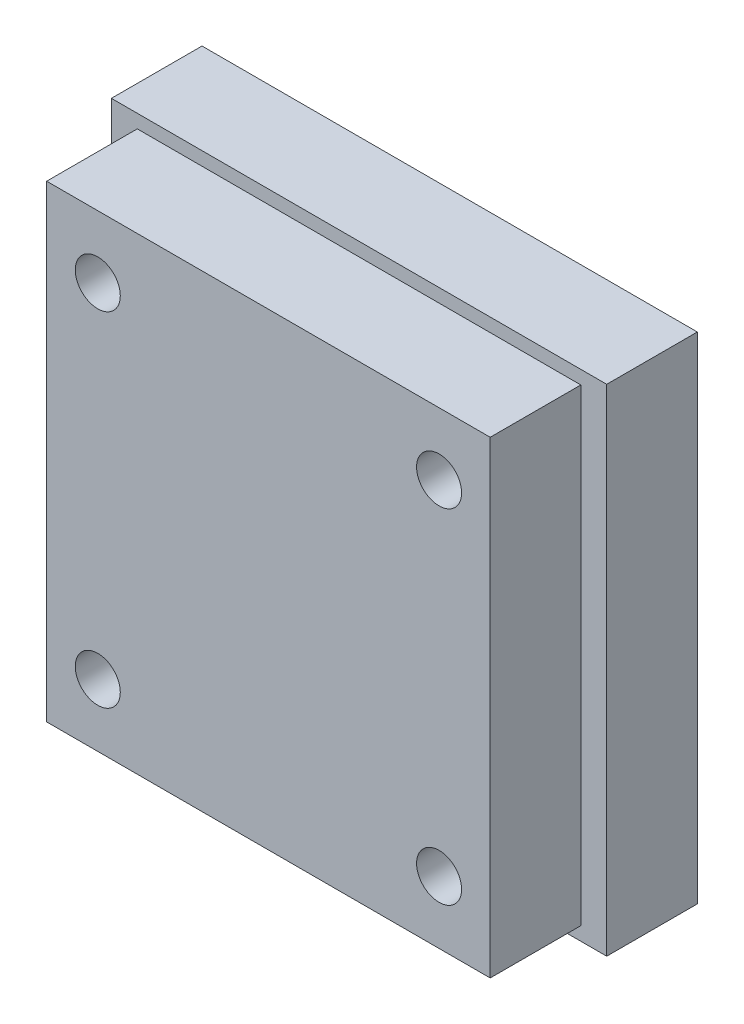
ISO-10303-21;
HEADER;
FILE_DESCRIPTION(('STEP AP214'),'2;1');
FILE_NAME('part.step','',(''),(''),'','','');
FILE_SCHEMA(('AUTOMOTIVE_DESIGN { 1 0 10303 214 1 1 1 1 }'));
ENDSEC;
DATA;
#1=APPLICATION_CONTEXT('core data for automotive mechanical design processes');
#2=APPLICATION_PROTOCOL_DEFINITION('international standard','automotive_design',2000,#1);
#3=PRODUCT_CONTEXT('',#1,'mechanical');
#4=PRODUCT('Part','Part','',(#3));
#5=PRODUCT_RELATED_PRODUCT_CATEGORY('part','',(#4));
#6=PRODUCT_DEFINITION_FORMATION('','',#4);
#7=PRODUCT_DEFINITION_CONTEXT('part definition',#1,'design');
#8=PRODUCT_DEFINITION('design','',#6,#7);
#9=PRODUCT_DEFINITION_SHAPE('','',#8);
#10=(LENGTH_UNIT() NAMED_UNIT(*) SI_UNIT(.MILLI.,.METRE.));
#11=(NAMED_UNIT(*) PLANE_ANGLE_UNIT() SI_UNIT($,.RADIAN.));
#12=(NAMED_UNIT(*) SI_UNIT($,.STERADIAN.) SOLID_ANGLE_UNIT());
#13=UNCERTAINTY_MEASURE_WITH_UNIT(LENGTH_MEASURE(1.E-05),#10,'distance_accuracy_value','');
#14=(GEOMETRIC_REPRESENTATION_CONTEXT(3) GLOBAL_UNCERTAINTY_ASSIGNED_CONTEXT((#13)) GLOBAL_UNIT_ASSIGNED_CONTEXT((#10,
#11,#12)) REPRESENTATION_CONTEXT('',''));
#15=CARTESIAN_POINT('',(0.,0.,0.));
#16=DIRECTION('',(0.,0.,1.));
#17=DIRECTION('',(1.,0.,0.));
#18=AXIS2_PLACEMENT_3D('',#15,#16,#17);
#19=CARTESIAN_POINT('',(0.,0.,8.05));
#20=DIRECTION('',(0.,0.,-1.));
#21=DIRECTION('',(-1.,0.,0.));
#22=AXIS2_PLACEMENT_3D('',#19,#20,#21);
#23=PLANE('',#22);
#24=DIRECTION('',(0.,1.,0.));
#25=VECTOR('',#24,1.);
#26=CARTESIAN_POINT('',(22.,-22.,8.05));
#27=LINE('',#26,#25);
#28=CARTESIAN_POINT('',(22.,-22.,8.05));
#29=VERTEX_POINT('',#28);
#30=CARTESIAN_POINT('',(22.,22.,8.05));
#31=VERTEX_POINT('',#30);
#32=EDGE_CURVE('E149',#29,#31,#27,.T.);
#33=ORIENTED_EDGE('',*,*,#32,.T.);
#34=DIRECTION('',(-1.,0.,0.));
#35=VECTOR('',#34,1.);
#36=CARTESIAN_POINT('',(-22.,22.,8.05));
#37=LINE('',#36,#35);
#38=CARTESIAN_POINT('',(-22.,22.,8.05));
#39=VERTEX_POINT('',#38);
#40=EDGE_CURVE('E153',#31,#39,#37,.T.);
#41=ORIENTED_EDGE('',*,*,#40,.T.);
#42=DIRECTION('',(0.,-1.,0.));
#43=VECTOR('',#42,1.);
#44=CARTESIAN_POINT('',(-22.,-22.,8.05));
#45=LINE('',#44,#43);
#46=CARTESIAN_POINT('',(-22.,-22.,8.05));
#47=VERTEX_POINT('',#46);
#48=EDGE_CURVE('E157',#39,#47,#45,.T.);
#49=ORIENTED_EDGE('',*,*,#48,.T.);
#50=DIRECTION('',(1.,0.,0.));
#51=VECTOR('',#50,1.);
#52=CARTESIAN_POINT('',(-22.,-22.,8.05));
#53=LINE('',#52,#51);
#54=EDGE_CURVE('E160',#47,#29,#53,.T.);
#55=ORIENTED_EDGE('',*,*,#54,.T.);
#56=EDGE_LOOP('',(#33,#41,#49,#55));
#57=FACE_BOUND('',#56,.T.);
#58=DIRECTION('',(0.,1.,0.));
#59=VECTOR('',#58,1.);
#60=CARTESIAN_POINT('',(19.7,-20.8,8.05));
#61=LINE('',#60,#59);
#62=CARTESIAN_POINT('',(19.7,-20.8,8.05));
#63=VERTEX_POINT('',#62);
#64=CARTESIAN_POINT('',(19.7,20.8,8.05));
#65=VERTEX_POINT('',#64);
#66=EDGE_CURVE('E65',#63,#65,#61,.T.);
#67=ORIENTED_EDGE('',*,*,#66,.F.);
#68=DIRECTION('',(1.,0.,0.));
#69=VECTOR('',#68,1.);
#70=CARTESIAN_POINT('',(-19.7,-20.8,8.05));
#71=LINE('',#70,#69);
#72=CARTESIAN_POINT('',(-19.7,-20.8,8.05));
#73=VERTEX_POINT('',#72);
#74=EDGE_CURVE('E69',#73,#63,#71,.T.);
#75=ORIENTED_EDGE('',*,*,#74,.F.);
#76=DIRECTION('',(0.,-1.,0.));
#77=VECTOR('',#76,1.);
#78=CARTESIAN_POINT('',(-19.7,-20.8,8.05));
#79=LINE('',#78,#77);
#80=CARTESIAN_POINT('',(-19.7,20.8,8.05));
#81=VERTEX_POINT('',#80);
#82=EDGE_CURVE('E428',#81,#73,#79,.T.);
#83=ORIENTED_EDGE('',*,*,#82,.F.);
#84=DIRECTION('',(-1.,0.,0.));
#85=VECTOR('',#84,1.);
#86=CARTESIAN_POINT('',(-19.7,20.8,8.05));
#87=LINE('',#86,#85);
#88=EDGE_CURVE('E425',#65,#81,#87,.T.);
#89=ORIENTED_EDGE('',*,*,#88,.F.);
#90=EDGE_LOOP('',(#67,#75,#83,#89));
#91=FACE_BOUND('',#90,.T.);
#92=ADVANCED_FACE('F49',(#57,#91),#23,.F.);
#93=CARTESIAN_POINT('',(22.,-22.,8.05));
#94=DIRECTION('',(-1.,0.,0.));
#95=DIRECTION('',(0.,0.,1.));
#96=AXIS2_PLACEMENT_3D('',#93,#94,#95);
#97=PLANE('',#96);
#98=DIRECTION('',(0.,1.,0.));
#99=VECTOR('',#98,1.);
#100=CARTESIAN_POINT('',(22.,-22.,0.));
#101=LINE('',#100,#99);
#102=CARTESIAN_POINT('',(22.,-22.,0.));
#103=VERTEX_POINT('',#102);
#104=CARTESIAN_POINT('',(22.,22.,0.));
#105=VERTEX_POINT('',#104);
#106=EDGE_CURVE('E138',#103,#105,#101,.T.);
#107=ORIENTED_EDGE('',*,*,#106,.T.);
#108=DIRECTION('',(0.,0.,-1.));
#109=VECTOR('',#108,1.);
#110=CARTESIAN_POINT('',(22.,22.,8.05));
#111=LINE('',#110,#109);
#112=EDGE_CURVE('E11',#31,#105,#111,.T.);
#113=ORIENTED_EDGE('',*,*,#112,.F.);
#114=ORIENTED_EDGE('',*,*,#32,.F.);
#115=DIRECTION('',(0.,0.,-1.));
#116=VECTOR('',#115,1.);
#117=CARTESIAN_POINT('',(22.,-22.,8.05));
#118=LINE('',#117,#116);
#119=EDGE_CURVE('E162',#29,#103,#118,.T.);
#120=ORIENTED_EDGE('',*,*,#119,.T.);
#121=EDGE_LOOP('',(#107,#113,#114,#120));
#122=FACE_BOUND('',#121,.T.);
#123=ADVANCED_FACE('F51',(#122),#97,.F.);
#124=CARTESIAN_POINT('',(-22.,22.,8.05));
#125=DIRECTION('',(0.,-1.,0.));
#126=DIRECTION('',(0.,0.,-1.));
#127=AXIS2_PLACEMENT_3D('',#124,#125,#126);
#128=PLANE('',#127);
#129=DIRECTION('',(-1.,0.,0.));
#130=VECTOR('',#129,1.);
#131=CARTESIAN_POINT('',(-22.,22.,0.));
#132=LINE('',#131,#130);
#133=CARTESIAN_POINT('',(-22.,22.,0.));
#134=VERTEX_POINT('',#133);
#135=EDGE_CURVE('E143',#105,#134,#132,.T.);
#136=ORIENTED_EDGE('',*,*,#135,.T.);
#137=DIRECTION('',(0.,0.,-1.));
#138=VECTOR('',#137,1.);
#139=CARTESIAN_POINT('',(-22.,22.,8.05));
#140=LINE('',#139,#138);
#141=EDGE_CURVE('E58',#39,#134,#140,.T.);
#142=ORIENTED_EDGE('',*,*,#141,.F.);
#143=ORIENTED_EDGE('',*,*,#40,.F.);
#144=ORIENTED_EDGE('',*,*,#112,.T.);
#145=EDGE_LOOP('',(#136,#142,#143,#144));
#146=FACE_BOUND('',#145,.T.);
#147=ADVANCED_FACE('F198',(#146),#128,.F.);
#148=CARTESIAN_POINT('',(-22.,-22.,8.05));
#149=DIRECTION('',(1.,0.,0.));
#150=DIRECTION('',(0.,0.,-1.));
#151=AXIS2_PLACEMENT_3D('',#148,#149,#150);
#152=PLANE('',#151);
#153=DIRECTION('',(0.,-1.,0.));
#154=VECTOR('',#153,1.);
#155=CARTESIAN_POINT('',(-22.,-22.,0.));
#156=LINE('',#155,#154);
#157=CARTESIAN_POINT('',(-22.,-22.,0.));
#158=VERTEX_POINT('',#157);
#159=EDGE_CURVE('E166',#134,#158,#156,.T.);
#160=ORIENTED_EDGE('',*,*,#159,.T.);
#161=DIRECTION('',(0.,0.,-1.));
#162=VECTOR('',#161,1.);
#163=CARTESIAN_POINT('',(-22.,-22.,8.05));
#164=LINE('',#163,#162);
#165=EDGE_CURVE('E174',#47,#158,#164,.T.);
#166=ORIENTED_EDGE('',*,*,#165,.F.);
#167=ORIENTED_EDGE('',*,*,#48,.F.);
#168=ORIENTED_EDGE('',*,*,#141,.T.);
#169=EDGE_LOOP('',(#160,#166,#167,#168));
#170=FACE_BOUND('',#169,.T.);
#171=ADVANCED_FACE('F183',(#170),#152,.F.);
#172=CARTESIAN_POINT('',(-22.,-22.,8.05));
#173=DIRECTION('',(0.,1.,0.));
#174=DIRECTION('',(-1.,0.,0.));
#175=AXIS2_PLACEMENT_3D('',#172,#173,#174);
#176=PLANE('',#175);
#177=DIRECTION('',(1.,0.,0.));
#178=VECTOR('',#177,1.);
#179=CARTESIAN_POINT('',(-22.,-22.,0.));
#180=LINE('',#179,#178);
#181=EDGE_CURVE('E154',#158,#103,#180,.T.);
#182=ORIENTED_EDGE('',*,*,#181,.T.);
#183=ORIENTED_EDGE('',*,*,#119,.F.);
#184=ORIENTED_EDGE('',*,*,#54,.F.);
#185=ORIENTED_EDGE('',*,*,#165,.T.);
#186=EDGE_LOOP('',(#182,#183,#184,#185));
#187=FACE_BOUND('',#186,.T.);
#188=ADVANCED_FACE('F192',(#187),#176,.F.);
#189=CARTESIAN_POINT('',(0.,0.,0.));
#190=DIRECTION('',(0.,0.,-1.));
#191=DIRECTION('',(-1.,0.,0.));
#192=AXIS2_PLACEMENT_3D('',#189,#190,#191);
#193=PLANE('',#192);
#194=CARTESIAN_POINT('',(-15.16,-15.25,0.));
#195=DIRECTION('',(0.,0.,1.));
#196=DIRECTION('',(1.,0.,0.));
#197=AXIS2_PLACEMENT_3D('',#194,#195,#196);
#198=CIRCLE('',#197,2.);
#199=CARTESIAN_POINT('',(-13.16,-15.25,0.));
#200=VERTEX_POINT('',#199);
#201=EDGE_CURVE('E394',#200,#200,#198,.T.);
#202=ORIENTED_EDGE('',*,*,#201,.T.);
#203=EDGE_LOOP('',(#202));
#204=FACE_BOUND('',#203,.T.);
#205=CARTESIAN_POINT('',(15.16,-15.25,0.));
#206=DIRECTION('',(0.,0.,1.));
#207=DIRECTION('',(1.,0.,0.));
#208=AXIS2_PLACEMENT_3D('',#205,#206,#207);
#209=CIRCLE('',#208,2.);
#210=CARTESIAN_POINT('',(17.16,-15.25,0.));
#211=VERTEX_POINT('',#210);
#212=EDGE_CURVE('E399',#211,#211,#209,.T.);
#213=ORIENTED_EDGE('',*,*,#212,.T.);
#214=EDGE_LOOP('',(#213));
#215=FACE_BOUND('',#214,.T.);
#216=CARTESIAN_POINT('',(15.16,15.25,0.));
#217=DIRECTION('',(0.,0.,1.));
#218=DIRECTION('',(1.,0.,0.));
#219=AXIS2_PLACEMENT_3D('',#216,#217,#218);
#220=CIRCLE('',#219,2.);
#221=CARTESIAN_POINT('',(17.16,15.25,0.));
#222=VERTEX_POINT('',#221);
#223=EDGE_CURVE('E440',#222,#222,#220,.T.);
#224=ORIENTED_EDGE('',*,*,#223,.T.);
#225=EDGE_LOOP('',(#224));
#226=FACE_BOUND('',#225,.T.);
#227=CARTESIAN_POINT('',(-15.16,15.25,0.));
#228=DIRECTION('',(0.,0.,1.));
#229=DIRECTION('',(1.,0.,0.));
#230=AXIS2_PLACEMENT_3D('',#227,#228,#229);
#231=CIRCLE('',#230,2.);
#232=CARTESIAN_POINT('',(-13.16,15.25,0.));
#233=VERTEX_POINT('',#232);
#234=EDGE_CURVE('E409',#233,#233,#231,.T.);
#235=ORIENTED_EDGE('',*,*,#234,.T.);
#236=EDGE_LOOP('',(#235));
#237=FACE_BOUND('',#236,.T.);
#238=ORIENTED_EDGE('',*,*,#106,.F.);
#239=ORIENTED_EDGE('',*,*,#181,.F.);
#240=ORIENTED_EDGE('',*,*,#159,.F.);
#241=ORIENTED_EDGE('',*,*,#135,.F.);
#242=EDGE_LOOP('',(#238,#239,#240,#241));
#243=FACE_BOUND('',#242,.T.);
#244=ADVANCED_FACE('F189',(#204,#215,#226,#237,#243),#193,.T.);
#245=CARTESIAN_POINT('',(19.7,-20.8,16.1));
#246=DIRECTION('',(-1.,0.,0.));
#247=DIRECTION('',(0.,0.,1.));
#248=AXIS2_PLACEMENT_3D('',#245,#246,#247);
#249=PLANE('',#248);
#250=ORIENTED_EDGE('',*,*,#66,.T.);
#251=DIRECTION('',(0.,0.,-1.));
#252=VECTOR('',#251,1.);
#253=CARTESIAN_POINT('',(19.7,20.8,16.1));
#254=LINE('',#253,#252);
#255=CARTESIAN_POINT('',(19.7,20.8,16.1));
#256=VERTEX_POINT('',#255);
#257=EDGE_CURVE('E118',#256,#65,#254,.T.);
#258=ORIENTED_EDGE('',*,*,#257,.F.);
#259=DIRECTION('',(0.,1.,0.));
#260=VECTOR('',#259,1.);
#261=CARTESIAN_POINT('',(19.7,-20.8,16.1));
#262=LINE('',#261,#260);
#263=CARTESIAN_POINT('',(19.7,-20.8,16.1));
#264=VERTEX_POINT('',#263);
#265=EDGE_CURVE('E125',#264,#256,#262,.T.);
#266=ORIENTED_EDGE('',*,*,#265,.F.);
#267=DIRECTION('',(0.,0.,-1.));
#268=VECTOR('',#267,1.);
#269=CARTESIAN_POINT('',(19.7,-20.8,16.1));
#270=LINE('',#269,#268);
#271=EDGE_CURVE('E422',#264,#63,#270,.T.);
#272=ORIENTED_EDGE('',*,*,#271,.T.);
#273=EDGE_LOOP('',(#250,#258,#266,#272));
#274=FACE_BOUND('',#273,.T.);
#275=ADVANCED_FACE('F136',(#274),#249,.F.);
#276=CARTESIAN_POINT('',(-19.7,20.8,16.1));
#277=DIRECTION('',(0.,-1.,0.));
#278=DIRECTION('',(0.,0.,-1.));
#279=AXIS2_PLACEMENT_3D('',#276,#277,#278);
#280=PLANE('',#279);
#281=ORIENTED_EDGE('',*,*,#88,.T.);
#282=DIRECTION('',(0.,0.,-1.));
#283=VECTOR('',#282,1.);
#284=CARTESIAN_POINT('',(-19.7,20.8,16.1));
#285=LINE('',#284,#283);
#286=CARTESIAN_POINT('',(-19.7,20.8,16.1));
#287=VERTEX_POINT('',#286);
#288=EDGE_CURVE('E120',#287,#81,#285,.T.);
#289=ORIENTED_EDGE('',*,*,#288,.F.);
#290=DIRECTION('',(-1.,0.,0.));
#291=VECTOR('',#290,1.);
#292=CARTESIAN_POINT('',(-19.7,20.8,16.1));
#293=LINE('',#292,#291);
#294=EDGE_CURVE('E113',#256,#287,#293,.T.);
#295=ORIENTED_EDGE('',*,*,#294,.F.);
#296=ORIENTED_EDGE('',*,*,#257,.T.);
#297=EDGE_LOOP('',(#281,#289,#295,#296));
#298=FACE_BOUND('',#297,.T.);
#299=ADVANCED_FACE('F116',(#298),#280,.F.);
#300=CARTESIAN_POINT('',(-19.7,-20.8,16.1));
#301=DIRECTION('',(1.,0.,0.));
#302=DIRECTION('',(0.,0.,-1.));
#303=AXIS2_PLACEMENT_3D('',#300,#301,#302);
#304=PLANE('',#303);
#305=ORIENTED_EDGE('',*,*,#82,.T.);
#306=DIRECTION('',(0.,0.,-1.));
#307=VECTOR('',#306,1.);
#308=CARTESIAN_POINT('',(-19.7,-20.8,16.1));
#309=LINE('',#308,#307);
#310=CARTESIAN_POINT('',(-19.7,-20.8,16.1));
#311=VERTEX_POINT('',#310);
#312=EDGE_CURVE('E145',#311,#73,#309,.T.);
#313=ORIENTED_EDGE('',*,*,#312,.F.);
#314=DIRECTION('',(0.,-1.,0.));
#315=VECTOR('',#314,1.);
#316=CARTESIAN_POINT('',(-19.7,-20.8,16.1));
#317=LINE('',#316,#315);
#318=EDGE_CURVE('E124',#287,#311,#317,.T.);
#319=ORIENTED_EDGE('',*,*,#318,.F.);
#320=ORIENTED_EDGE('',*,*,#288,.T.);
#321=EDGE_LOOP('',(#305,#313,#319,#320));
#322=FACE_BOUND('',#321,.T.);
#323=ADVANCED_FACE('F235',(#322),#304,.F.);
#324=CARTESIAN_POINT('',(-19.7,-20.8,16.1));
#325=DIRECTION('',(0.,1.,0.));
#326=DIRECTION('',(0.,0.,1.));
#327=AXIS2_PLACEMENT_3D('',#324,#325,#326);
#328=PLANE('',#327);
#329=ORIENTED_EDGE('',*,*,#74,.T.);
#330=ORIENTED_EDGE('',*,*,#271,.F.);
#331=DIRECTION('',(1.,0.,0.));
#332=VECTOR('',#331,1.);
#333=CARTESIAN_POINT('',(-19.7,-20.8,16.1));
#334=LINE('',#333,#332);
#335=EDGE_CURVE('E130',#311,#264,#334,.T.);
#336=ORIENTED_EDGE('',*,*,#335,.F.);
#337=ORIENTED_EDGE('',*,*,#312,.T.);
#338=EDGE_LOOP('',(#329,#330,#336,#337));
#339=FACE_BOUND('',#338,.T.);
#340=ADVANCED_FACE('F241',(#339),#328,.F.);
#341=CARTESIAN_POINT('',(0.,0.,16.1));
#342=DIRECTION('',(0.,0.,-1.));
#343=DIRECTION('',(-1.,0.,0.));
#344=AXIS2_PLACEMENT_3D('',#341,#342,#343);
#345=PLANE('',#344);
#346=CARTESIAN_POINT('',(-15.16,-15.25,16.1));
#347=DIRECTION('',(0.,0.,1.));
#348=DIRECTION('',(1.,0.,0.));
#349=AXIS2_PLACEMENT_3D('',#346,#347,#348);
#350=CIRCLE('',#349,2.);
#351=CARTESIAN_POINT('',(-13.16,-15.25,16.1));
#352=VERTEX_POINT('',#351);
#353=EDGE_CURVE('E397',#352,#352,#350,.T.);
#354=ORIENTED_EDGE('',*,*,#353,.F.);
#355=EDGE_LOOP('',(#354));
#356=FACE_BOUND('',#355,.T.);
#357=CARTESIAN_POINT('',(15.16,-15.25,16.1));
#358=DIRECTION('',(0.,0.,1.));
#359=DIRECTION('',(1.,0.,0.));
#360=AXIS2_PLACEMENT_3D('',#357,#358,#359);
#361=CIRCLE('',#360,2.);
#362=CARTESIAN_POINT('',(17.16,-15.25,16.1));
#363=VERTEX_POINT('',#362);
#364=EDGE_CURVE('E404',#363,#363,#361,.T.);
#365=ORIENTED_EDGE('',*,*,#364,.F.);
#366=EDGE_LOOP('',(#365));
#367=FACE_BOUND('',#366,.T.);
#368=CARTESIAN_POINT('',(15.16,15.25,16.1));
#369=DIRECTION('',(0.,0.,1.));
#370=DIRECTION('',(1.,0.,0.));
#371=AXIS2_PLACEMENT_3D('',#368,#369,#370);
#372=CIRCLE('',#371,2.);
#373=CARTESIAN_POINT('',(17.16,15.25,16.1));
#374=VERTEX_POINT('',#373);
#375=EDGE_CURVE('E416',#374,#374,#372,.T.);
#376=ORIENTED_EDGE('',*,*,#375,.F.);
#377=EDGE_LOOP('',(#376));
#378=FACE_BOUND('',#377,.T.);
#379=CARTESIAN_POINT('',(-15.16,15.25,16.1));
#380=DIRECTION('',(0.,0.,1.));
#381=DIRECTION('',(1.,0.,0.));
#382=AXIS2_PLACEMENT_3D('',#379,#380,#381);
#383=CIRCLE('',#382,2.);
#384=CARTESIAN_POINT('',(-13.16,15.25,16.1));
#385=VERTEX_POINT('',#384);
#386=EDGE_CURVE('E413',#385,#385,#383,.T.);
#387=ORIENTED_EDGE('',*,*,#386,.F.);
#388=EDGE_LOOP('',(#387));
#389=FACE_BOUND('',#388,.T.);
#390=ORIENTED_EDGE('',*,*,#265,.T.);
#391=ORIENTED_EDGE('',*,*,#294,.T.);
#392=ORIENTED_EDGE('',*,*,#318,.T.);
#393=ORIENTED_EDGE('',*,*,#335,.T.);
#394=EDGE_LOOP('',(#390,#391,#392,#393));
#395=FACE_BOUND('',#394,.T.);
#396=ADVANCED_FACE('F128',(#356,#367,#378,#389,#395),#345,.F.);
#397=CARTESIAN_POINT('',(-15.16,15.25,0.));
#398=DIRECTION('',(0.,0.,1.));
#399=DIRECTION('',(1.,0.,0.));
#400=AXIS2_PLACEMENT_3D('',#397,#398,#399);
#401=CYLINDRICAL_SURFACE('',#400,2.);
#402=ORIENTED_EDGE('',*,*,#234,.F.);
#403=EDGE_LOOP('',(#402));
#404=FACE_BOUND('',#403,.T.);
#405=ORIENTED_EDGE('',*,*,#386,.T.);
#406=EDGE_LOOP('',(#405));
#407=FACE_BOUND('',#406,.T.);
#408=ADVANCED_FACE('F256',(#404,#407),#401,.F.);
#409=CARTESIAN_POINT('',(15.16,15.25,0.));
#410=DIRECTION('',(0.,0.,1.));
#411=DIRECTION('',(1.,0.,0.));
#412=AXIS2_PLACEMENT_3D('',#409,#410,#411);
#413=CYLINDRICAL_SURFACE('',#412,2.);
#414=ORIENTED_EDGE('',*,*,#223,.F.);
#415=EDGE_LOOP('',(#414));
#416=FACE_BOUND('',#415,.T.);
#417=ORIENTED_EDGE('',*,*,#375,.T.);
#418=EDGE_LOOP('',(#417));
#419=FACE_BOUND('',#418,.T.);
#420=ADVANCED_FACE('F264',(#416,#419),#413,.F.);
#421=CARTESIAN_POINT('',(15.16,-15.25,0.));
#422=DIRECTION('',(0.,0.,1.));
#423=DIRECTION('',(1.,0.,0.));
#424=AXIS2_PLACEMENT_3D('',#421,#422,#423);
#425=CYLINDRICAL_SURFACE('',#424,2.);
#426=ORIENTED_EDGE('',*,*,#212,.F.);
#427=EDGE_LOOP('',(#426));
#428=FACE_BOUND('',#427,.T.);
#429=ORIENTED_EDGE('',*,*,#364,.T.);
#430=EDGE_LOOP('',(#429));
#431=FACE_BOUND('',#430,.T.);
#432=ADVANCED_FACE('F272',(#428,#431),#425,.F.);
#433=CARTESIAN_POINT('',(-15.16,-15.25,0.));
#434=DIRECTION('',(0.,0.,1.));
#435=DIRECTION('',(1.,0.,0.));
#436=AXIS2_PLACEMENT_3D('',#433,#434,#435);
#437=CYLINDRICAL_SURFACE('',#436,2.);
#438=ORIENTED_EDGE('',*,*,#201,.F.);
#439=EDGE_LOOP('',(#438));
#440=FACE_BOUND('',#439,.T.);
#441=ORIENTED_EDGE('',*,*,#353,.T.);
#442=EDGE_LOOP('',(#441));
#443=FACE_BOUND('',#442,.T.);
#444=ADVANCED_FACE('F280',(#440,#443),#437,.F.);
#445=CLOSED_SHELL('',(#92,#123,#147,#171,#188,#244,#275,#299,#323,#340,#396,#408,#420,#432,#444));
#446=MANIFOLD_SOLID_BREP('B2',#445);
#447=ADVANCED_BREP_SHAPE_REPRESENTATION('',(#18,#446),#14);
#448=SHAPE_DEFINITION_REPRESENTATION(#9,#447);
ENDSEC;
END-ISO-10303-21;
